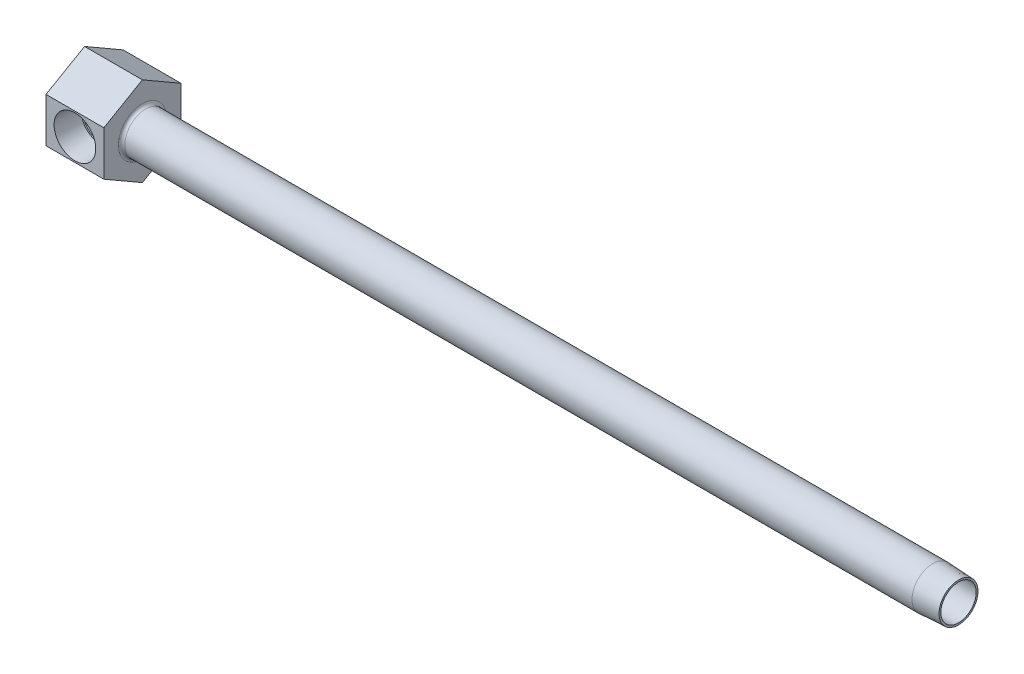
ISO-10303-21;
HEADER;
FILE_DESCRIPTION(('STEP AP214'),'2;1');
FILE_NAME('part.step','',(''),(''),'','','');
FILE_SCHEMA(('AUTOMOTIVE_DESIGN { 1 0 10303 214 1 1 1 1 }'));
ENDSEC;
DATA;
#1=APPLICATION_CONTEXT('core data for automotive mechanical design processes');
#2=APPLICATION_PROTOCOL_DEFINITION('international standard','automotive_design',2000,#1);
#3=PRODUCT_CONTEXT('',#1,'mechanical');
#4=PRODUCT('Part','Part','',(#3));
#5=PRODUCT_RELATED_PRODUCT_CATEGORY('part','',(#4));
#6=PRODUCT_DEFINITION_FORMATION('','',#4);
#7=PRODUCT_DEFINITION_CONTEXT('part definition',#1,'design');
#8=PRODUCT_DEFINITION('design','',#6,#7);
#9=PRODUCT_DEFINITION_SHAPE('','',#8);
#10=(LENGTH_UNIT() NAMED_UNIT(*) SI_UNIT(.MILLI.,.METRE.));
#11=(NAMED_UNIT(*) PLANE_ANGLE_UNIT() SI_UNIT($,.RADIAN.));
#12=(NAMED_UNIT(*) SI_UNIT($,.STERADIAN.) SOLID_ANGLE_UNIT());
#13=UNCERTAINTY_MEASURE_WITH_UNIT(LENGTH_MEASURE(1.E-05),#10,'distance_accuracy_value','');
#14=(GEOMETRIC_REPRESENTATION_CONTEXT(3) GLOBAL_UNCERTAINTY_ASSIGNED_CONTEXT((#13)) GLOBAL_UNIT_ASSIGNED_CONTEXT((#10,
#11,#12)) REPRESENTATION_CONTEXT('',''));
#15=CARTESIAN_POINT('',(0.,0.,0.));
#16=DIRECTION('',(0.,0.,1.));
#17=DIRECTION('',(1.,0.,0.));
#18=AXIS2_PLACEMENT_3D('',#15,#16,#17);
#19=CARTESIAN_POINT('',(7.14375,0.,19.05));
#20=DIRECTION('',(0.,0.,1.));
#21=DIRECTION('',(1.,0.,0.));
#22=AXIS2_PLACEMENT_3D('',#19,#20,#21);
#23=CONICAL_SURFACE('',#22,5.1435,0.0523598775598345);
#24=CARTESIAN_POINT('',(7.14375,0.,19.05));
#25=DIRECTION('',(0.,0.,-1.));
#26=DIRECTION('',(-1.,0.,0.));
#27=AXIS2_PLACEMENT_3D('',#24,#25,#26);
#28=CIRCLE('',#27,5.1435);
#29=CARTESIAN_POINT('',(2.00025,0.,19.05));
#30=VERTEX_POINT('',#29);
#31=EDGE_CURVE('E512',#30,#30,#28,.T.);
#32=ORIENTED_EDGE('',*,*,#31,.F.);
#33=EDGE_LOOP('',(#32));
#34=FACE_BOUND('',#33,.T.);
#35=CARTESIAN_POINT('',(7.14375,0.,12.7000000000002));
#36=DIRECTION('',(0.,0.,-1.));
#37=DIRECTION('',(-1.,0.,0.));
#38=AXIS2_PLACEMENT_3D('',#35,#36,#37);
#39=CIRCLE('',#38,4.81071060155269);
#40=CARTESIAN_POINT('',(10.9073758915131,-2.99634054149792,12.7000000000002));
#41=VERTEX_POINT('',#40);
#42=CARTESIAN_POINT('',(10.9073758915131,2.99634054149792,12.7000000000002));
#43=VERTEX_POINT('',#42);
#44=EDGE_CURVE('E528',#41,#43,#39,.T.);
#45=ORIENTED_EDGE('',*,*,#44,.T.);
#46=CARTESIAN_POINT('',(10.9071937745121,2.99655245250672,12.6998000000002));
#47=CARTESIAN_POINT('',(10.971635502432,2.92155827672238,12.7705639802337));
#48=CARTESIAN_POINT('',(11.0345784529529,2.84341410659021,12.8393139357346));
#49=CARTESIAN_POINT('',(11.1569073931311,2.68056902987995,12.9723675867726));
#50=CARTESIAN_POINT('',(11.2162880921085,2.59585877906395,13.0366646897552));
#51=CARTESIAN_POINT('',(11.3887731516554,2.33059710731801,13.2228141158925));
#52=CARTESIAN_POINT('',(11.4952955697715,2.13996459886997,13.3369144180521));
#53=CARTESIAN_POINT('',(11.6670238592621,1.76978922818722,13.520146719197));
#54=CARTESIAN_POINT('',(11.7362081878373,1.59429861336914,13.5936668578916));
#55=CARTESIAN_POINT('',(11.8243838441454,1.32069459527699,13.6871793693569));
#56=CARTESIAN_POINT('',(11.8511557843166,1.22786736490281,13.7155347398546));
#57=CARTESIAN_POINT('',(11.8990876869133,1.0391950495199,13.7662595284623));
#58=CARTESIAN_POINT('',(11.9202500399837,0.943351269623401,13.7886314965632));
#59=CARTESIAN_POINT('',(11.9566990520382,0.748466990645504,13.8271421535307));
#60=CARTESIAN_POINT('',(11.971935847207,0.649406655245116,13.8432279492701));
#61=CARTESIAN_POINT('',(11.9959472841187,0.449682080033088,13.8685692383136));
#62=CARTESIAN_POINT('',(12.0047249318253,0.349018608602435,13.8778279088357));
#63=CARTESIAN_POINT('',(12.0156291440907,0.146869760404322,13.8893288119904));
#64=CARTESIAN_POINT('',(12.0177517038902,0.0453839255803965,13.8915668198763));
#65=CARTESIAN_POINT('',(12.0152840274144,-0.157407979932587,13.8889645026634));
#66=CARTESIAN_POINT('',(12.0106943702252,-0.258714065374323,13.8841247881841));
#67=CARTESIAN_POINT('',(11.9957865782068,-0.449057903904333,13.8683984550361));
#68=CARTESIAN_POINT('',(11.9861593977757,-0.538211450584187,13.8582411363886));
#69=CARTESIAN_POINT('',(11.961864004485,-0.715062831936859,13.8325939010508));
#70=CARTESIAN_POINT('',(11.9471941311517,-0.802760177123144,13.8171022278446));
#71=CARTESIAN_POINT('',(11.8959888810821,-1.06271154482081,13.762990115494));
#72=CARTESIAN_POINT('',(11.8522396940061,-1.23204639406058,13.7167134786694));
#73=CARTESIAN_POINT('',(11.7458224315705,-1.56656708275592,13.6038703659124));
#74=CARTESIAN_POINT('',(11.6823922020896,-1.73122409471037,13.5364852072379));
#75=CARTESIAN_POINT('',(11.5406571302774,-2.04618319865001,13.3853583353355));
#76=CARTESIAN_POINT('',(11.4623317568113,-2.19646504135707,13.3015940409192));
#77=CARTESIAN_POINT('',(11.3067680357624,-2.45998630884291,13.1343941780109));
#78=CARTESIAN_POINT('',(11.2311482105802,-2.57539375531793,13.0528153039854));
#79=CARTESIAN_POINT('',(11.0735639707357,-2.79452635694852,12.8818550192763));
#80=CARTESIAN_POINT('',(10.9916301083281,-2.89830245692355,12.792510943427));
#81=CARTESIAN_POINT('',(10.9071937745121,-2.99655245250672,12.6998000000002));
#82=B_SPLINE_CURVE_WITH_KNOTS('',3,(#46,#47,#48,#49,#50,#51,#52,#53,#54,#55,#56,#57,#58,#59,#60,
#61,#62,#63,#64,#65,#66,#67,#68,#69,#70,#71,#72,#73,#74,#75,#76,#77,#78,#79,#80,#81),
.UNSPECIFIED.,.F.,.F.,(4,2,2,2,2,2,2,2,2,2,2,2,2,2,2,2,2,4),(0.,0.364634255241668,
0.72979730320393,1.46525067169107,2.06997219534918,2.37170467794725,2.67330836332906,
2.97739780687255,3.28134564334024,3.58547634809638,3.88958081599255,4.15999530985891,
4.43049893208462,4.97084503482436,5.53548493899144,6.10090884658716,6.58103480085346,
7.05896806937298),.UNSPECIFIED.);
#83=EDGE_CURVE('E123',#43,#41,#82,.T.);
#84=ORIENTED_EDGE('',*,*,#83,.T.);
#85=EDGE_LOOP('',(#45,#84));
#86=FACE_BOUND('',#85,.T.);
#87=ADVANCED_FACE('F15',(#34,#86),#23,.F.);
#88=CARTESIAN_POINT('',(11.9544606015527,0.,12.7000000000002));
#89=DIRECTION('',(0.,0.,1.));
#90=DIRECTION('',(1.,0.,0.));
#91=AXIS2_PLACEMENT_3D('',#88,#89,#90);
#92=PLANE('',#91);
#93=ORIENTED_EDGE('',*,*,#44,.F.);
#94=DIRECTION('',(1.,0.,0.));
#95=VECTOR('',#94,1.);
#96=CARTESIAN_POINT('',(66.1375087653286,-2.99634054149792,12.7000000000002));
#97=LINE('',#96,#95);
#98=CARTESIAN_POINT('',(10.3187500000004,-2.99634054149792,12.7000000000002));
#99=VERTEX_POINT('',#98);
#100=EDGE_CURVE('E120',#41,#99,#97,.F.);
#101=ORIENTED_EDGE('',*,*,#100,.T.);
#102=CARTESIAN_POINT('',(7.14375,0.,12.7000000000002));
#103=DIRECTION('',(0.,0.,-1.));
#104=DIRECTION('',(-1.,0.,0.));
#105=AXIS2_PLACEMENT_3D('',#102,#103,#104);
#106=CIRCLE('',#105,4.36562500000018);
#107=CARTESIAN_POINT('',(10.3187500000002,2.99634054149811,12.7000000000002));
#108=VERTEX_POINT('',#107);
#109=EDGE_CURVE('E119',#99,#108,#106,.T.);
#110=ORIENTED_EDGE('',*,*,#109,.T.);
#111=DIRECTION('',(1.,0.,0.));
#112=VECTOR('',#111,1.);
#113=CARTESIAN_POINT('',(66.1375087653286,2.99634054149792,12.7000000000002));
#114=LINE('',#113,#112);
#115=EDGE_CURVE('E126',#108,#43,#114,.T.);
#116=ORIENTED_EDGE('',*,*,#115,.T.);
#117=EDGE_LOOP('',(#93,#101,#110,#116));
#118=FACE_BOUND('',#117,.T.);
#119=ADVANCED_FACE('F156',(#118),#92,.T.);
#120=CARTESIAN_POINT('',(7.14375,0.,35.9059426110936));
#121=DIRECTION('',(0.,0.,-1.));
#122=DIRECTION('',(-1.,0.,0.));
#123=AXIS2_PLACEMENT_3D('',#120,#121,#122);
#124=CYLINDRICAL_SURFACE('',#123,4.36562500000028);
#125=ORIENTED_EDGE('',*,*,#109,.F.);
#126=CARTESIAN_POINT('',(7.14375,0.,9.525));
#127=DIRECTION('',(0.707106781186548,0.,-0.707106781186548));
#128=DIRECTION('',(-0.707106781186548,0.,-0.707106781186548));
#129=AXIS2_PLACEMENT_3D('',#126,#127,#128);
#130=ELLIPSE('',#129,6.17392608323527,4.36562500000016);
#131=CARTESIAN_POINT('',(7.14375,-4.3656250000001,9.525));
#132=VERTEX_POINT('',#131);
#133=EDGE_CURVE('E105',#99,#132,#130,.T.);
#134=ORIENTED_EDGE('',*,*,#133,.T.);
#135=CARTESIAN_POINT('',(7.14375,0.,9.525));
#136=DIRECTION('',(-0.707106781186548,0.,-0.707106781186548));
#137=DIRECTION('',(0.707106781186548,0.,-0.707106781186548));
#138=AXIS2_PLACEMENT_3D('',#135,#136,#137);
#139=ELLIPSE('',#138,6.17392608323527,4.36562500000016);
#140=CARTESIAN_POINT('',(8.98888023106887,-3.95653586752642,7.67986976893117));
#141=VERTEX_POINT('',#140);
#142=EDGE_CURVE('E100',#132,#141,#139,.F.);
#143=ORIENTED_EDGE('',*,*,#142,.T.);
#144=CARTESIAN_POINT('',(7.14375,0.,7.67986976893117));
#145=DIRECTION('',(0.,0.,-1.));
#146=DIRECTION('',(-1.,0.,0.));
#147=AXIS2_PLACEMENT_3D('',#144,#145,#146);
#148=CIRCLE('',#147,4.36562500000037);
#149=CARTESIAN_POINT('',(8.98888023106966,3.95653586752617,7.67986976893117));
#150=VERTEX_POINT('',#149);
#151=EDGE_CURVE('E113',#141,#150,#148,.T.);
#152=ORIENTED_EDGE('',*,*,#151,.T.);
#153=CARTESIAN_POINT('',(7.14375,4.3656250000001,9.525));
#154=VERTEX_POINT('',#153);
#155=EDGE_CURVE('E30',#150,#154,#139,.F.);
#156=ORIENTED_EDGE('',*,*,#155,.T.);
#157=EDGE_CURVE('E122',#154,#108,#130,.T.);
#158=ORIENTED_EDGE('',*,*,#157,.T.);
#159=EDGE_LOOP('',(#125,#134,#143,#152,#156,#158));
#160=FACE_BOUND('',#159,.T.);
#161=ADVANCED_FACE('F116',(#160),#124,.F.);
#162=CARTESIAN_POINT('',(7.14375,0.,7.67986976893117));
#163=DIRECTION('',(0.,0.,1.));
#164=DIRECTION('',(1.,0.,0.));
#165=AXIS2_PLACEMENT_3D('',#162,#163,#164);
#166=CONICAL_SURFACE('',#165,4.36562500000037,1.0471975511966);
#167=ORIENTED_EDGE('',*,*,#151,.F.);
#168=CARTESIAN_POINT('',(8.9894997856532,-3.95662913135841,7.68006976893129));
#169=CARTESIAN_POINT('',(8.91497560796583,-3.94541760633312,7.6560189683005));
#170=CARTESIAN_POINT('',(8.84020256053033,-3.93428272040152,7.6327193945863));
#171=CARTESIAN_POINT('',(8.69001846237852,-3.91242782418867,7.58793860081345));
#172=CARTESIAN_POINT('',(8.61460714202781,-3.90170800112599,7.56645819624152));
#173=CARTESIAN_POINT('',(8.38848524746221,-3.87074056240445,7.50556917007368));
#174=CARTESIAN_POINT('',(8.2367287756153,-3.8515020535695,7.46932807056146));
#175=CARTESIAN_POINT('',(8.00667896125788,-3.82676825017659,7.42384959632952));
#176=CARTESIAN_POINT('',(7.92948623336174,-3.81920348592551,7.41015805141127));
#177=CARTESIAN_POINT('',(7.77441965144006,-3.80585437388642,7.38622945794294));
#178=CARTESIAN_POINT('',(7.69654594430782,-3.80006965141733,7.37599168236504));
#179=CARTESIAN_POINT('',(7.53967894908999,-3.79060206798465,7.35933225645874));
#180=CARTESIAN_POINT('',(7.46068163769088,-3.78693482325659,7.35293894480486));
#181=CARTESIAN_POINT('',(7.30231301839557,-3.7819879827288,7.34434534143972));
#182=CARTESIAN_POINT('',(7.2229414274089,-3.78071064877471,7.34214902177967));
#183=CARTESIAN_POINT('',(7.14355,-3.78074215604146,7.34218750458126));
#184=B_SPLINE_CURVE_WITH_KNOTS('',3,(#168,#169,#170,#171,#172,#173,#174,#175,#176,#177,#178,
#179,#180,#181,#182,#183),.UNSPECIFIED.,.F.,.F.,(4,2,2,2,2,2,2,4),(0.,0.237303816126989,
0.474713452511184,0.945835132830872,1.18204117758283,1.41819746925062,1.65607385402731,
1.89417525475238),.UNSPECIFIED.);
#185=CARTESIAN_POINT('',(7.14375,-3.78074215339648,7.34218750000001));
#186=VERTEX_POINT('',#185);
#187=EDGE_CURVE('E109',#141,#186,#184,.T.);
#188=ORIENTED_EDGE('',*,*,#187,.T.);
#189=DIRECTION('',(0.,0.866025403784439,-0.5));
#190=VECTOR('',#189,1.);
#191=CARTESIAN_POINT('',(7.14375,0.,5.159375));
#192=LINE('',#191,#190);
#193=CARTESIAN_POINT('',(7.14375,0.,5.159375));
#194=VERTEX_POINT('',#193);
#195=EDGE_CURVE('E200',#186,#194,#192,.T.);
#196=ORIENTED_EDGE('',*,*,#195,.T.);
#197=DIRECTION('',(0.,0.866025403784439,0.5));
#198=VECTOR('',#197,1.);
#199=CARTESIAN_POINT('',(7.14375,0.,5.159375));
#200=LINE('',#199,#198);
#201=CARTESIAN_POINT('',(7.14375,3.78074215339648,7.34218750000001));
#202=VERTEX_POINT('',#201);
#203=EDGE_CURVE('E486',#194,#202,#200,.T.);
#204=ORIENTED_EDGE('',*,*,#203,.T.);
#205=CARTESIAN_POINT('',(7.14355,3.78074215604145,7.34218750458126));
#206=CARTESIAN_POINT('',(7.20515303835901,3.78073202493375,7.34217451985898));
#207=CARTESIAN_POINT('',(7.26674694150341,3.78149280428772,7.34348695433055));
#208=CARTESIAN_POINT('',(7.38976236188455,3.78448017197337,7.34867189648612));
#209=CARTESIAN_POINT('',(7.45118394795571,3.78670605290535,7.3525431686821));
#210=CARTESIAN_POINT('',(7.63466542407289,3.79545033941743,7.36782927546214));
#211=CARTESIAN_POINT('',(7.75632841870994,3.80403629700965,7.38291749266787));
#212=CARTESIAN_POINT('',(8.11659337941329,3.83592256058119,7.44024735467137));
#213=CARTESIAN_POINT('',(8.35266311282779,3.8653919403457,7.49460284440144));
#214=CARTESIAN_POINT('',(8.65303625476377,3.90716169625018,7.57737916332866));
#215=CARTESIAN_POINT('',(8.72054620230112,3.91683509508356,7.59689306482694));
#216=CARTESIAN_POINT('',(8.855265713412,3.93652410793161,7.63741882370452));
#217=CARTESIAN_POINT('',(8.92247399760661,3.94654056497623,7.65843453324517));
#218=CARTESIAN_POINT('',(8.9894997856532,3.9566291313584,7.68006976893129));
#219=B_SPLINE_CURVE_WITH_KNOTS('',3,(#205,#206,#207,#208,#209,#210,#211,#212,#213,#214,#215,
#216,#217,#218),.UNSPECIFIED.,.F.,.F.,(4,2,2,2,2,2,4),(0.,0.184774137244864,0.369459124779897,
0.73767480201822,1.46761028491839,1.68043381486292,1.89382432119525),.UNSPECIFIED.);
#220=EDGE_CURVE('E187',#202,#150,#219,.T.);
#221=ORIENTED_EDGE('',*,*,#220,.T.);
#222=EDGE_LOOP('',(#167,#188,#196,#204,#221));
#223=FACE_BOUND('',#222,.T.);
#224=ADVANCED_FACE('F201',(#223),#166,.F.);
#225=CARTESIAN_POINT('',(14.2875,5.4992613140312,19.05));
#226=DIRECTION('',(0.,0.,-1.));
#227=DIRECTION('',(-1.,0.,0.));
#228=AXIS2_PLACEMENT_3D('',#225,#226,#227);
#229=PLANE('',#228);
#230=DIRECTION('',(0.,-1.,0.));
#231=VECTOR('',#230,1.);
#232=CARTESIAN_POINT('',(0.,5.4992613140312,19.05));
#233=LINE('',#232,#231);
#234=CARTESIAN_POINT('',(0.,5.4992613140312,19.05));
#235=VERTEX_POINT('',#234);
#236=CARTESIAN_POINT('',(0.,-5.49926131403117,19.05));
#237=VERTEX_POINT('',#236);
#238=EDGE_CURVE('E515',#235,#237,#233,.T.);
#239=ORIENTED_EDGE('',*,*,#238,.T.);
#240=DIRECTION('',(-1.,0.,0.));
#241=VECTOR('',#240,1.);
#242=CARTESIAN_POINT('',(14.2875,-5.49926131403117,19.05));
#243=LINE('',#242,#241);
#244=CARTESIAN_POINT('',(14.2875,-5.49926131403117,19.05));
#245=VERTEX_POINT('',#244);
#246=EDGE_CURVE('E496',#245,#237,#243,.T.);
#247=ORIENTED_EDGE('',*,*,#246,.F.);
#248=DIRECTION('',(0.,-1.,0.));
#249=VECTOR('',#248,1.);
#250=CARTESIAN_POINT('',(14.2875,5.4992613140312,19.05));
#251=LINE('',#250,#249);
#252=CARTESIAN_POINT('',(14.2875,5.4992613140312,19.05));
#253=VERTEX_POINT('',#252);
#254=EDGE_CURVE('E502',#253,#245,#251,.T.);
#255=ORIENTED_EDGE('',*,*,#254,.F.);
#256=DIRECTION('',(-1.,0.,0.));
#257=VECTOR('',#256,1.);
#258=CARTESIAN_POINT('',(14.2875,5.4992613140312,19.05));
#259=LINE('',#258,#257);
#260=EDGE_CURVE('E493',#253,#235,#259,.T.);
#261=ORIENTED_EDGE('',*,*,#260,.T.);
#262=EDGE_LOOP('',(#239,#247,#255,#261));
#263=FACE_BOUND('',#262,.T.);
#264=ORIENTED_EDGE('',*,*,#31,.T.);
#265=EDGE_LOOP('',(#264));
#266=FACE_BOUND('',#265,.T.);
#267=ADVANCED_FACE('F204',(#263,#266),#229,.F.);
#268=CARTESIAN_POINT('',(14.2875,-5.49926131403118,0.));
#269=DIRECTION('',(1.,0.,0.));
#270=DIRECTION('',(0.,1.,0.));
#271=AXIS2_PLACEMENT_3D('',#268,#269,#270);
#272=PLANE('',#271);
#273=CARTESIAN_POINT('',(14.2875,0.,9.525));
#274=DIRECTION('',(1.,0.,0.));
#275=DIRECTION('',(0.,1.,0.));
#276=AXIS2_PLACEMENT_3D('',#273,#274,#275);
#277=CIRCLE('',#276,5.9309);
#278=CARTESIAN_POINT('',(14.2875,5.9309,9.525));
#279=VERTEX_POINT('',#278);
#280=EDGE_CURVE('E199',#279,#279,#277,.F.);
#281=ORIENTED_EDGE('',*,*,#280,.T.);
#282=EDGE_LOOP('',(#281));
#283=FACE_BOUND('',#282,.T.);
#284=DIRECTION('',(0.,0.5,-0.866025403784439));
#285=VECTOR('',#284,1.);
#286=CARTESIAN_POINT('',(14.2875,-10.9985226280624,9.525));
#287=LINE('',#286,#285);
#288=CARTESIAN_POINT('',(14.2875,-10.9985226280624,9.525));
#289=VERTEX_POINT('',#288);
#290=CARTESIAN_POINT('',(14.2875,-5.49926131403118,0.));
#291=VERTEX_POINT('',#290);
#292=EDGE_CURVE('E473',#289,#291,#287,.T.);
#293=ORIENTED_EDGE('',*,*,#292,.T.);
#294=DIRECTION('',(0.,1.,0.));
#295=VECTOR('',#294,1.);
#296=CARTESIAN_POINT('',(14.2875,-5.49926131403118,0.));
#297=LINE('',#296,#295);
#298=CARTESIAN_POINT('',(14.2875,5.49926131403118,0.));
#299=VERTEX_POINT('',#298);
#300=EDGE_CURVE('E475',#291,#299,#297,.T.);
#301=ORIENTED_EDGE('',*,*,#300,.T.);
#302=DIRECTION('',(0.,0.5,0.866025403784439));
#303=VECTOR('',#302,1.);
#304=CARTESIAN_POINT('',(14.2875,5.49926131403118,0.));
#305=LINE('',#304,#303);
#306=CARTESIAN_POINT('',(14.2875,10.9985226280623,9.525));
#307=VERTEX_POINT('',#306);
#308=EDGE_CURVE('E506',#299,#307,#305,.T.);
#309=ORIENTED_EDGE('',*,*,#308,.T.);
#310=DIRECTION('',(0.,-0.5,0.86602540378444));
#311=VECTOR('',#310,1.);
#312=CARTESIAN_POINT('',(14.2875,10.9985226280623,9.525));
#313=LINE('',#312,#311);
#314=EDGE_CURVE('E504',#307,#253,#313,.T.);
#315=ORIENTED_EDGE('',*,*,#314,.T.);
#316=ORIENTED_EDGE('',*,*,#254,.T.);
#317=DIRECTION('',(0.,-0.5,-0.866025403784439));
#318=VECTOR('',#317,1.);
#319=CARTESIAN_POINT('',(14.2875,-5.49926131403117,19.05));
#320=LINE('',#319,#318);
#321=EDGE_CURVE('E38',#245,#289,#320,.T.);
#322=ORIENTED_EDGE('',*,*,#321,.T.);
#323=EDGE_LOOP('',(#293,#301,#309,#315,#316,#322));
#324=FACE_BOUND('',#323,.T.);
#325=ADVANCED_FACE('F230',(#283,#324),#272,.T.);
#326=CARTESIAN_POINT('',(14.2875,-10.9985226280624,9.525));
#327=DIRECTION('',(0.,0.866025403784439,0.5));
#328=DIRECTION('',(0.,-0.5,0.866025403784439));
#329=AXIS2_PLACEMENT_3D('',#326,#327,#328);
#330=PLANE('',#329);
#331=DIRECTION('',(0.,0.5,-0.866025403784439));
#332=VECTOR('',#331,1.);
#333=CARTESIAN_POINT('',(0.,-10.9985226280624,9.525));
#334=LINE('',#333,#332);
#335=CARTESIAN_POINT('',(0.,-10.9985226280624,9.525));
#336=VERTEX_POINT('',#335);
#337=CARTESIAN_POINT('',(0.,-5.49926131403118,0.));
#338=VERTEX_POINT('',#337);
#339=EDGE_CURVE('E484',#336,#338,#334,.T.);
#340=ORIENTED_EDGE('',*,*,#339,.T.);
#341=DIRECTION('',(-1.,0.,0.));
#342=VECTOR('',#341,1.);
#343=CARTESIAN_POINT('',(14.2875,-5.49926131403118,0.));
#344=LINE('',#343,#342);
#345=EDGE_CURVE('E482',#291,#338,#344,.T.);
#346=ORIENTED_EDGE('',*,*,#345,.F.);
#347=ORIENTED_EDGE('',*,*,#292,.F.);
#348=DIRECTION('',(-1.,0.,0.));
#349=VECTOR('',#348,1.);
#350=CARTESIAN_POINT('',(14.2875,-10.9985226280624,9.525));
#351=LINE('',#350,#349);
#352=EDGE_CURVE('E499',#289,#336,#351,.T.);
#353=ORIENTED_EDGE('',*,*,#352,.T.);
#354=EDGE_LOOP('',(#340,#346,#347,#353));
#355=FACE_BOUND('',#354,.T.);
#356=ADVANCED_FACE('F239',(#355),#330,.F.);
#357=CARTESIAN_POINT('',(14.2875,-5.49926131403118,0.));
#358=DIRECTION('',(0.,0.,1.));
#359=DIRECTION('',(0.,-1.,0.));
#360=AXIS2_PLACEMENT_3D('',#357,#358,#359);
#361=PLANE('',#360);
#362=DIRECTION('',(0.,1.,0.));
#363=VECTOR('',#362,1.);
#364=CARTESIAN_POINT('',(0.,-5.49926131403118,0.));
#365=LINE('',#364,#363);
#366=CARTESIAN_POINT('',(0.,5.49926131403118,0.));
#367=VERTEX_POINT('',#366);
#368=EDGE_CURVE('E511',#338,#367,#365,.T.);
#369=ORIENTED_EDGE('',*,*,#368,.T.);
#370=DIRECTION('',(-1.,0.,0.));
#371=VECTOR('',#370,1.);
#372=CARTESIAN_POINT('',(14.2875,5.49926131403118,0.));
#373=LINE('',#372,#371);
#374=EDGE_CURVE('E485',#299,#367,#373,.T.);
#375=ORIENTED_EDGE('',*,*,#374,.F.);
#376=ORIENTED_EDGE('',*,*,#300,.F.);
#377=ORIENTED_EDGE('',*,*,#345,.T.);
#378=EDGE_LOOP('',(#369,#375,#376,#377));
#379=FACE_BOUND('',#378,.T.);
#380=ADVANCED_FACE('F247',(#379),#361,.F.);
#381=CARTESIAN_POINT('',(14.2875,5.49926131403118,0.));
#382=DIRECTION('',(0.,-0.866025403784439,0.5));
#383=DIRECTION('',(0.,-0.5,-0.866025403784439));
#384=AXIS2_PLACEMENT_3D('',#381,#382,#383);
#385=PLANE('',#384);
#386=DIRECTION('',(0.,0.5,0.866025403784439));
#387=VECTOR('',#386,1.);
#388=CARTESIAN_POINT('',(0.,5.49926131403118,0.));
#389=LINE('',#388,#387);
#390=CARTESIAN_POINT('',(0.,10.9985226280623,9.525));
#391=VERTEX_POINT('',#390);
#392=EDGE_CURVE('E521',#367,#391,#389,.T.);
#393=ORIENTED_EDGE('',*,*,#392,.T.);
#394=DIRECTION('',(-1.,0.,0.));
#395=VECTOR('',#394,1.);
#396=CARTESIAN_POINT('',(14.2875,10.9985226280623,9.525));
#397=LINE('',#396,#395);
#398=EDGE_CURVE('E488',#307,#391,#397,.T.);
#399=ORIENTED_EDGE('',*,*,#398,.F.);
#400=ORIENTED_EDGE('',*,*,#308,.F.);
#401=ORIENTED_EDGE('',*,*,#374,.T.);
#402=EDGE_LOOP('',(#393,#399,#400,#401));
#403=FACE_BOUND('',#402,.T.);
#404=ADVANCED_FACE('F255',(#403),#385,.F.);
#405=CARTESIAN_POINT('',(14.2875,10.9985226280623,9.525));
#406=DIRECTION('',(0.,-0.86602540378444,-0.5));
#407=DIRECTION('',(0.,0.5,-0.86602540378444));
#408=AXIS2_PLACEMENT_3D('',#405,#406,#407);
#409=PLANE('',#408);
#410=DIRECTION('',(0.,-0.5,0.86602540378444));
#411=VECTOR('',#410,1.);
#412=CARTESIAN_POINT('',(0.,10.9985226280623,9.525));
#413=LINE('',#412,#411);
#414=EDGE_CURVE('E518',#391,#235,#413,.T.);
#415=ORIENTED_EDGE('',*,*,#414,.T.);
#416=ORIENTED_EDGE('',*,*,#260,.F.);
#417=ORIENTED_EDGE('',*,*,#314,.F.);
#418=ORIENTED_EDGE('',*,*,#398,.T.);
#419=EDGE_LOOP('',(#415,#416,#417,#418));
#420=FACE_BOUND('',#419,.T.);
#421=ADVANCED_FACE('F264',(#420),#409,.F.);
#422=CARTESIAN_POINT('',(14.2875,-5.49926131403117,19.05));
#423=DIRECTION('',(0.,0.866025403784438,-0.5));
#424=DIRECTION('',(0.,0.5,0.866025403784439));
#425=AXIS2_PLACEMENT_3D('',#422,#423,#424);
#426=PLANE('',#425);
#427=DIRECTION('',(0.,-0.5,-0.866025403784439));
#428=VECTOR('',#427,1.);
#429=CARTESIAN_POINT('',(0.,-5.49926131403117,19.05));
#430=LINE('',#429,#428);
#431=EDGE_CURVE('E478',#237,#336,#430,.T.);
#432=ORIENTED_EDGE('',*,*,#431,.T.);
#433=ORIENTED_EDGE('',*,*,#352,.F.);
#434=ORIENTED_EDGE('',*,*,#321,.F.);
#435=ORIENTED_EDGE('',*,*,#246,.T.);
#436=EDGE_LOOP('',(#432,#433,#434,#435));
#437=FACE_BOUND('',#436,.T.);
#438=ADVANCED_FACE('F273',(#437),#426,.F.);
#439=CARTESIAN_POINT('',(0.,-5.49926131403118,0.));
#440=DIRECTION('',(1.,0.,0.));
#441=DIRECTION('',(0.,1.,0.));
#442=AXIS2_PLACEMENT_3D('',#439,#440,#441);
#443=PLANE('',#442);
#444=ORIENTED_EDGE('',*,*,#339,.F.);
#445=ORIENTED_EDGE('',*,*,#431,.F.);
#446=ORIENTED_EDGE('',*,*,#238,.F.);
#447=ORIENTED_EDGE('',*,*,#414,.F.);
#448=ORIENTED_EDGE('',*,*,#392,.F.);
#449=ORIENTED_EDGE('',*,*,#368,.F.);
#450=EDGE_LOOP('',(#444,#445,#446,#447,#448,#449));
#451=FACE_BOUND('',#450,.T.);
#452=ADVANCED_FACE('F170',(#451),#443,.F.);
#453=CARTESIAN_POINT('',(68.0114010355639,0.,9.525));
#454=DIRECTION('',(-1.,0.,0.));
#455=DIRECTION('',(0.,0.,1.));
#456=AXIS2_PLACEMENT_3D('',#453,#454,#455);
#457=CYLINDRICAL_SURFACE('',#456,5.1435);
#458=CARTESIAN_POINT('',(209.55,0.,9.525));
#459=DIRECTION('',(-1.,0.,0.));
#460=DIRECTION('',(0.,0.,1.));
#461=AXIS2_PLACEMENT_3D('',#458,#459,#460);
#462=CIRCLE('',#461,5.1435);
#463=CARTESIAN_POINT('',(209.55,0.,14.6685));
#464=VERTEX_POINT('',#463);
#465=EDGE_CURVE('E10',#464,#464,#462,.F.);
#466=ORIENTED_EDGE('',*,*,#465,.F.);
#467=EDGE_LOOP('',(#466));
#468=FACE_BOUND('',#467,.T.);
#469=CARTESIAN_POINT('',(15.0749,0.,9.525));
#470=DIRECTION('',(1.,0.,0.));
#471=DIRECTION('',(0.,1.,0.));
#472=AXIS2_PLACEMENT_3D('',#469,#470,#471);
#473=CIRCLE('',#472,5.1435);
#474=CARTESIAN_POINT('',(15.0749,5.1435,9.525));
#475=VERTEX_POINT('',#474);
#476=EDGE_CURVE('E23',#475,#475,#473,.T.);
#477=ORIENTED_EDGE('',*,*,#476,.T.);
#478=EDGE_LOOP('',(#477));
#479=FACE_BOUND('',#478,.T.);
#480=ADVANCED_FACE('F17',(#468,#479),#457,.T.);
#481=CARTESIAN_POINT('',(7.14375,0.,9.525));
#482=DIRECTION('',(1.,0.,0.));
#483=DIRECTION('',(0.,0.,-1.));
#484=AXIS2_PLACEMENT_3D('',#481,#482,#483);
#485=PLANE('',#484);
#486=CARTESIAN_POINT('',(7.14375,0.,9.525));
#487=DIRECTION('',(1.,0.,0.));
#488=DIRECTION('',(0.,0.,-1.));
#489=AXIS2_PLACEMENT_3D('',#486,#487,#488);
#490=CIRCLE('',#489,4.365625);
#491=EDGE_CURVE('E130',#194,#202,#490,.T.);
#492=ORIENTED_EDGE('',*,*,#491,.T.);
#493=ORIENTED_EDGE('',*,*,#203,.F.);
#494=EDGE_LOOP('',(#492,#493));
#495=FACE_BOUND('',#494,.T.);
#496=ADVANCED_FACE('F297',(#495),#485,.T.);
#497=EDGE_CURVE('E128',#186,#194,#490,.T.);
#498=ORIENTED_EDGE('',*,*,#497,.T.);
#499=ORIENTED_EDGE('',*,*,#195,.F.);
#500=EDGE_LOOP('',(#498,#499));
#501=FACE_BOUND('',#500,.T.);
#502=ADVANCED_FACE('F182',(#501),#485,.T.);
#503=CARTESIAN_POINT('',(66.1375087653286,0.,9.525));
#504=DIRECTION('',(1.,0.,0.));
#505=DIRECTION('',(0.,0.,-1.));
#506=AXIS2_PLACEMENT_3D('',#503,#504,#505);
#507=CYLINDRICAL_SURFACE('',#506,4.365625);
#508=ORIENTED_EDGE('',*,*,#142,.F.);
#509=ORIENTED_EDGE('',*,*,#133,.F.);
#510=ORIENTED_EDGE('',*,*,#100,.F.);
#511=ORIENTED_EDGE('',*,*,#83,.F.);
#512=ORIENTED_EDGE('',*,*,#115,.F.);
#513=ORIENTED_EDGE('',*,*,#157,.F.);
#514=ORIENTED_EDGE('',*,*,#155,.F.);
#515=ORIENTED_EDGE('',*,*,#220,.F.);
#516=ORIENTED_EDGE('',*,*,#491,.F.);
#517=ORIENTED_EDGE('',*,*,#497,.F.);
#518=ORIENTED_EDGE('',*,*,#187,.F.);
#519=EDGE_LOOP('',(#508,#509,#510,#511,#512,#513,#514,#515,#516,#517,#518));
#520=FACE_BOUND('',#519,.T.);
#521=CARTESIAN_POINT('',(215.9,0.,9.525));
#522=DIRECTION('',(1.,0.,0.));
#523=DIRECTION('',(0.,0.,-1.));
#524=AXIS2_PLACEMENT_3D('',#521,#522,#523);
#525=CIRCLE('',#524,4.365625);
#526=CARTESIAN_POINT('',(215.9,0.,5.159375));
#527=VERTEX_POINT('',#526);
#528=EDGE_CURVE('E134',#527,#527,#525,.T.);
#529=ORIENTED_EDGE('',*,*,#528,.T.);
#530=EDGE_LOOP('',(#529));
#531=FACE_BOUND('',#530,.T.);
#532=ADVANCED_FACE('F102',(#520,#531),#507,.F.);
#533=CARTESIAN_POINT('',(15.0749,0.,9.525));
#534=DIRECTION('',(1.,0.,0.));
#535=DIRECTION('',(0.,1.,0.));
#536=AXIS2_PLACEMENT_3D('',#533,#534,#535);
#537=TOROIDAL_SURFACE('',#536,5.9309,0.7874);
#538=ORIENTED_EDGE('',*,*,#476,.F.);
#539=EDGE_LOOP('',(#538));
#540=FACE_BOUND('',#539,.T.);
#541=ORIENTED_EDGE('',*,*,#280,.F.);
#542=EDGE_LOOP('',(#541));
#543=FACE_BOUND('',#542,.T.);
#544=ADVANCED_FACE('F153',(#540,#543),#537,.F.);
#545=CARTESIAN_POINT('',(215.9,0.,5.159375));
#546=DIRECTION('',(1.,0.,0.));
#547=DIRECTION('',(0.,0.,-1.));
#548=AXIS2_PLACEMENT_3D('',#545,#546,#547);
#549=PLANE('',#548);
#550=CARTESIAN_POINT('',(215.9,0.,9.525));
#551=DIRECTION('',(1.,0.,0.));
#552=DIRECTION('',(0.,0.,-1.));
#553=AXIS2_PLACEMENT_3D('',#550,#551,#552);
#554=CIRCLE('',#553,4.81071060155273);
#555=CARTESIAN_POINT('',(215.9,0.,4.71428939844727));
#556=VERTEX_POINT('',#555);
#557=EDGE_CURVE('E137',#556,#556,#554,.T.);
#558=ORIENTED_EDGE('',*,*,#557,.T.);
#559=EDGE_LOOP('',(#558));
#560=FACE_BOUND('',#559,.T.);
#561=ORIENTED_EDGE('',*,*,#528,.F.);
#562=EDGE_LOOP('',(#561));
#563=FACE_BOUND('',#562,.T.);
#564=ADVANCED_FACE('F141',(#560,#563),#549,.T.);
#565=CARTESIAN_POINT('',(215.9,0.,9.525));
#566=DIRECTION('',(-1.,0.,0.));
#567=DIRECTION('',(0.,0.,1.));
#568=AXIS2_PLACEMENT_3D('',#565,#566,#567);
#569=CONICAL_SURFACE('',#568,4.81071060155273,0.052359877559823);
#570=ORIENTED_EDGE('',*,*,#465,.T.);
#571=EDGE_LOOP('',(#570));
#572=FACE_BOUND('',#571,.T.);
#573=ORIENTED_EDGE('',*,*,#557,.F.);
#574=EDGE_LOOP('',(#573));
#575=FACE_BOUND('',#574,.T.);
#576=ADVANCED_FACE('F144',(#572,#575),#569,.T.);
#577=CLOSED_SHELL('',(#87,#119,#161,#224,#267,#325,#356,#380,#404,#421,#438,#452,#480,#496,#502,
#532,#544,#564,#576));
#578=MANIFOLD_SOLID_BREP('B1',#577);
#579=ADVANCED_BREP_SHAPE_REPRESENTATION('',(#18,#578),#14);
#580=SHAPE_DEFINITION_REPRESENTATION(#9,#579);
ENDSEC;
END-ISO-10303-21;
